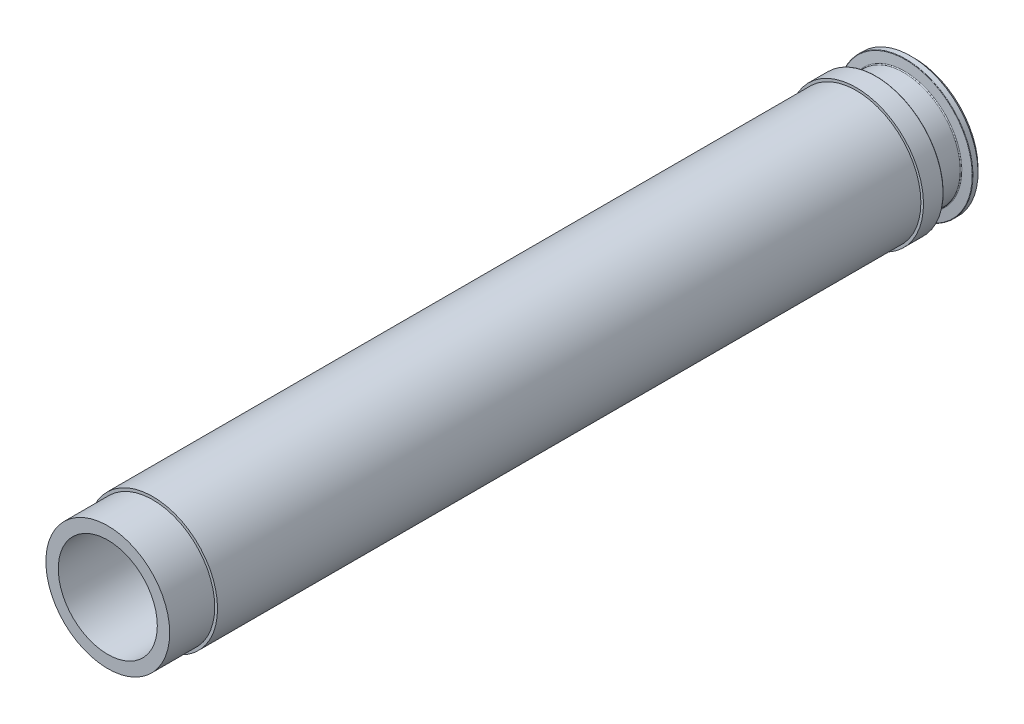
ISO-10303-21;
HEADER;
FILE_DESCRIPTION(('STEP AP214'),'2;1');
FILE_NAME('part.step','',(''),(''),'','','');
FILE_SCHEMA(('AUTOMOTIVE_DESIGN { 1 0 10303 214 1 1 1 1 }'));
ENDSEC;
DATA;
#1=APPLICATION_CONTEXT('core data for automotive mechanical design processes');
#2=APPLICATION_PROTOCOL_DEFINITION('international standard','automotive_design',2000,#1);
#3=PRODUCT_CONTEXT('',#1,'mechanical');
#4=PRODUCT('Part','Part','',(#3));
#5=PRODUCT_RELATED_PRODUCT_CATEGORY('part','',(#4));
#6=PRODUCT_DEFINITION_FORMATION('','',#4);
#7=PRODUCT_DEFINITION_CONTEXT('part definition',#1,'design');
#8=PRODUCT_DEFINITION('design','',#6,#7);
#9=PRODUCT_DEFINITION_SHAPE('','',#8);
#10=(LENGTH_UNIT() NAMED_UNIT(*) SI_UNIT(.MILLI.,.METRE.));
#11=(NAMED_UNIT(*) PLANE_ANGLE_UNIT() SI_UNIT($,.RADIAN.));
#12=(NAMED_UNIT(*) SI_UNIT($,.STERADIAN.) SOLID_ANGLE_UNIT());
#13=UNCERTAINTY_MEASURE_WITH_UNIT(LENGTH_MEASURE(1.E-05),#10,'distance_accuracy_value','');
#14=(GEOMETRIC_REPRESENTATION_CONTEXT(3) GLOBAL_UNCERTAINTY_ASSIGNED_CONTEXT((#13)) GLOBAL_UNIT_ASSIGNED_CONTEXT((#10,
#11,#12)) REPRESENTATION_CONTEXT('',''));
#15=CARTESIAN_POINT('',(0.,0.,0.));
#16=DIRECTION('',(0.,0.,1.));
#17=DIRECTION('',(1.,0.,0.));
#18=AXIS2_PLACEMENT_3D('',#15,#16,#17);
#19=CARTESIAN_POINT('',(0.,0.,-12.7));
#20=DIRECTION('',(0.,0.,1.));
#21=DIRECTION('',(1.,0.,0.));
#22=AXIS2_PLACEMENT_3D('',#19,#20,#21);
#23=CYLINDRICAL_SURFACE('',#22,17.4625);
#24=CARTESIAN_POINT('',(0.,0.,-12.7));
#25=DIRECTION('',(0.,0.,1.));
#26=DIRECTION('',(1.,0.,0.));
#27=AXIS2_PLACEMENT_3D('',#24,#25,#26);
#28=CIRCLE('',#27,17.4625);
#29=CARTESIAN_POINT('',(17.4625,0.,-12.7));
#30=VERTEX_POINT('',#29);
#31=EDGE_CURVE('E29',#30,#30,#28,.T.);
#32=ORIENTED_EDGE('',*,*,#31,.T.);
#33=EDGE_LOOP('',(#32));
#34=FACE_BOUND('',#33,.T.);
#35=CARTESIAN_POINT('',(0.,0.,0.));
#36=DIRECTION('',(0.,0.,1.));
#37=DIRECTION('',(1.,0.,0.));
#38=AXIS2_PLACEMENT_3D('',#35,#36,#37);
#39=CIRCLE('',#38,17.4625);
#40=CARTESIAN_POINT('',(17.4625,0.,0.));
#41=VERTEX_POINT('',#40);
#42=EDGE_CURVE('E10',#41,#41,#39,.T.);
#43=ORIENTED_EDGE('',*,*,#42,.F.);
#44=EDGE_LOOP('',(#43));
#45=FACE_BOUND('',#44,.T.);
#46=ADVANCED_FACE('F26',(#34,#45),#23,.T.);
#47=CARTESIAN_POINT('',(0.,0.,0.));
#48=DIRECTION('',(0.,0.,1.));
#49=DIRECTION('',(1.,0.,0.));
#50=AXIS2_PLACEMENT_3D('',#47,#48,#49);
#51=PLANE('',#50);
#52=CARTESIAN_POINT('',(0.,0.,0.));
#53=DIRECTION('',(0.,0.,1.));
#54=DIRECTION('',(1.,0.,0.));
#55=AXIS2_PLACEMENT_3D('',#52,#53,#54);
#56=CIRCLE('',#55,13.97);
#57=CARTESIAN_POINT('',(13.97,0.,0.));
#58=VERTEX_POINT('',#57);
#59=EDGE_CURVE('E79',#58,#58,#56,.T.);
#60=ORIENTED_EDGE('',*,*,#59,.F.);
#61=EDGE_LOOP('',(#60));
#62=FACE_BOUND('',#61,.T.);
#63=ORIENTED_EDGE('',*,*,#42,.T.);
#64=EDGE_LOOP('',(#63));
#65=FACE_BOUND('',#64,.T.);
#66=ADVANCED_FACE('F85',(#62,#65),#51,.T.);
#67=CARTESIAN_POINT('',(0.,0.,-211.0994));
#68=DIRECTION('',(0.,0.,1.));
#69=DIRECTION('',(1.,0.,0.));
#70=AXIS2_PLACEMENT_3D('',#67,#68,#69);
#71=CYLINDRICAL_SURFACE('',#70,18.25625);
#72=CARTESIAN_POINT('',(0.,0.,-211.0994));
#73=DIRECTION('',(0.,0.,-1.));
#74=DIRECTION('',(-1.,0.,0.));
#75=AXIS2_PLACEMENT_3D('',#72,#73,#74);
#76=CIRCLE('',#75,18.25625);
#77=CARTESIAN_POINT('',(18.25625,0.,-211.0994));
#78=VERTEX_POINT('',#77);
#79=EDGE_CURVE('E36',#78,#78,#76,.T.);
#80=CARTESIAN_POINT('',(0.,0.,-12.7));
#81=DIRECTION('',(0.,0.,-1.));
#82=DIRECTION('',(-1.,0.,0.));
#83=AXIS2_PLACEMENT_3D('',#80,#81,#82);
#84=CIRCLE('',#83,18.25625);
#85=CARTESIAN_POINT('',(18.25625,0.,-12.7));
#86=VERTEX_POINT('',#85);
#87=EDGE_CURVE('E40',#86,#86,#84,.T.);
#88=CARTESIAN_POINT('',(18.25625,0.,-211.0994));
#89=CARTESIAN_POINT('',(18.25625,0.,-209.032739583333));
#90=CARTESIAN_POINT('',(18.25625,0.,-206.966079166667));
#91=CARTESIAN_POINT('',(18.25625,0.,-202.832758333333));
#92=CARTESIAN_POINT('',(18.25625,0.,-200.766097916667));
#93=CARTESIAN_POINT('',(18.25625,0.,-196.632777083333));
#94=CARTESIAN_POINT('',(18.25625,0.,-194.566116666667));
#95=CARTESIAN_POINT('',(18.25625,0.,-190.432795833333));
#96=CARTESIAN_POINT('',(18.25625,0.,-188.366135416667));
#97=CARTESIAN_POINT('',(18.25625,0.,-184.232814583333));
#98=CARTESIAN_POINT('',(18.25625,0.,-182.166154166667));
#99=CARTESIAN_POINT('',(18.25625,0.,-178.032833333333));
#100=CARTESIAN_POINT('',(18.25625,0.,-175.966172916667));
#101=CARTESIAN_POINT('',(18.25625,0.,-171.832852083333));
#102=CARTESIAN_POINT('',(18.25625,0.,-169.766191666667));
#103=CARTESIAN_POINT('',(18.25625,0.,-165.632870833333));
#104=CARTESIAN_POINT('',(18.25625,0.,-163.566210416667));
#105=CARTESIAN_POINT('',(18.25625,0.,-159.432889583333));
#106=CARTESIAN_POINT('',(18.25625,0.,-157.366229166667));
#107=CARTESIAN_POINT('',(18.25625,0.,-153.232908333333));
#108=CARTESIAN_POINT('',(18.25625,0.,-151.166247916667));
#109=CARTESIAN_POINT('',(18.25625,0.,-147.032927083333));
#110=CARTESIAN_POINT('',(18.25625,0.,-144.966266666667));
#111=CARTESIAN_POINT('',(18.25625,0.,-140.832945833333));
#112=CARTESIAN_POINT('',(18.25625,0.,-138.766285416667));
#113=CARTESIAN_POINT('',(18.25625,0.,-134.632964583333));
#114=CARTESIAN_POINT('',(18.25625,0.,-132.566304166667));
#115=CARTESIAN_POINT('',(18.25625,0.,-128.432983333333));
#116=CARTESIAN_POINT('',(18.25625,0.,-126.366322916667));
#117=CARTESIAN_POINT('',(18.25625,0.,-122.233002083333));
#118=CARTESIAN_POINT('',(18.25625,0.,-120.166341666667));
#119=CARTESIAN_POINT('',(18.25625,0.,-116.033020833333));
#120=CARTESIAN_POINT('',(18.25625,0.,-113.966360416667));
#121=CARTESIAN_POINT('',(18.25625,0.,-109.833039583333));
#122=CARTESIAN_POINT('',(18.25625,0.,-107.766379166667));
#123=CARTESIAN_POINT('',(18.25625,0.,-103.633058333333));
#124=CARTESIAN_POINT('',(18.25625,0.,-101.566397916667));
#125=CARTESIAN_POINT('',(18.25625,0.,-97.4330770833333));
#126=CARTESIAN_POINT('',(18.25625,0.,-95.3664166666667));
#127=CARTESIAN_POINT('',(18.25625,0.,-91.2330958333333));
#128=CARTESIAN_POINT('',(18.25625,0.,-89.1664354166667));
#129=CARTESIAN_POINT('',(18.25625,0.,-85.0331145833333));
#130=CARTESIAN_POINT('',(18.25625,0.,-82.9664541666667));
#131=CARTESIAN_POINT('',(18.25625,0.,-78.8331333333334));
#132=CARTESIAN_POINT('',(18.25625,0.,-76.7664729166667));
#133=CARTESIAN_POINT('',(18.25625,0.,-72.6331520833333));
#134=CARTESIAN_POINT('',(18.25625,0.,-70.5664916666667));
#135=CARTESIAN_POINT('',(18.25625,0.,-66.4331708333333));
#136=CARTESIAN_POINT('',(18.25625,0.,-64.3665104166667));
#137=CARTESIAN_POINT('',(18.25625,0.,-60.2331895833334));
#138=CARTESIAN_POINT('',(18.25625,0.,-58.1665291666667));
#139=CARTESIAN_POINT('',(18.25625,0.,-54.0332083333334));
#140=CARTESIAN_POINT('',(18.25625,0.,-51.9665479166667));
#141=CARTESIAN_POINT('',(18.25625,0.,-47.8332270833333));
#142=CARTESIAN_POINT('',(18.25625,0.,-45.7665666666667));
#143=CARTESIAN_POINT('',(18.25625,0.,-41.6332458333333));
#144=CARTESIAN_POINT('',(18.25625,0.,-39.5665854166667));
#145=CARTESIAN_POINT('',(18.25625,0.,-35.4332645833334));
#146=CARTESIAN_POINT('',(18.25625,0.,-33.3666041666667));
#147=CARTESIAN_POINT('',(18.25625,0.,-29.2332833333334));
#148=CARTESIAN_POINT('',(18.25625,0.,-27.1666229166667));
#149=CARTESIAN_POINT('',(18.25625,0.,-23.0333020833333));
#150=CARTESIAN_POINT('',(18.25625,0.,-20.9666416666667));
#151=CARTESIAN_POINT('',(18.25625,0.,-16.8333208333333));
#152=CARTESIAN_POINT('',(18.25625,0.,-14.7666604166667));
#153=CARTESIAN_POINT('',(18.25625,0.,-12.7));
#154=B_SPLINE_CURVE_WITH_KNOTS('',3,(#88,#89,#90,#91,#92,#93,#94,#95,#96,#97,#98,#99,#100,#101,
#102,#103,#104,#105,#106,#107,#108,#109,#110,#111,#112,#113,#114,#115,#116,#117,#118,#119,#120,
#121,#122,#123,#124,#125,#126,#127,#128,#129,#130,#131,#132,#133,#134,#135,#136,#137,#138,#139,
#140,#141,#142,#143,#144,#145,#146,#147,#148,#149,#150,#151,#152,#153),.UNSPECIFIED.,.F.,.F.,(4,
2,2,2,2,2,2,2,2,2,2,2,2,2,2,2,2,2,2,2,2,2,2,2,2,2,2,2,2,2,2,2,4),(0.,6.19998125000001,
12.3999625,18.59994375,24.799925,30.99990625,37.1998875,43.39986875,49.59985,55.79983125,
61.9998125,68.19979375,74.399775,80.59975625,86.7997375,92.99971875,99.1997,105.39968125,
111.5996625,117.79964375,123.999625,130.19960625,136.3995875,142.59956875,148.79955,
154.99953125,161.1995125,167.39949375,173.599475,179.79945625,185.9994375,192.19941875,
198.3994),.UNSPECIFIED.);
#155=EDGE_CURVE('BSEAM87',#78,#86,#154,.T.);
#156=ORIENTED_EDGE('',*,*,#79,.F.);
#157=ORIENTED_EDGE('',*,*,#87,.T.);
#158=ORIENTED_EDGE('',*,*,#155,.T.);
#159=ORIENTED_EDGE('',*,*,#155,.F.);
#160=EDGE_LOOP('',(#156,#158,#157,#159));
#161=FACE_BOUND('',#160,.T.);
#162=ADVANCED_FACE('F87',(#161),#71,.T.);
#163=CARTESIAN_POINT('',(0.,0.,-12.7));
#164=DIRECTION('',(0.,0.,-1.));
#165=DIRECTION('',(-1.,0.,0.));
#166=AXIS2_PLACEMENT_3D('',#163,#164,#165);
#167=PLANE('',#166);
#168=ORIENTED_EDGE('',*,*,#31,.F.);
#169=EDGE_LOOP('',(#168));
#170=FACE_BOUND('',#169,.T.);
#171=ORIENTED_EDGE('',*,*,#87,.F.);
#172=EDGE_LOOP('',(#171));
#173=FACE_BOUND('',#172,.T.);
#174=ADVANCED_FACE('F92',(#170,#173),#167,.F.);
#175=CARTESIAN_POINT('',(0.,0.,-211.0994));
#176=DIRECTION('',(0.,0.,-1.));
#177=DIRECTION('',(0.,1.,0.));
#178=AXIS2_PLACEMENT_3D('',#175,#176,#177);
#179=PLANE('',#178);
#180=CARTESIAN_POINT('',(0.,0.,-211.0994));
#181=DIRECTION('',(0.,0.,1.));
#182=DIRECTION('',(0.,-1.,0.));
#183=AXIS2_PLACEMENT_3D('',#180,#181,#182);
#184=CIRCLE('',#183,18.9865);
#185=CARTESIAN_POINT('',(0.,-18.9865,-211.0994));
#186=VERTEX_POINT('',#185);
#187=EDGE_CURVE('E58',#186,#186,#184,.T.);
#188=ORIENTED_EDGE('',*,*,#187,.T.);
#189=EDGE_LOOP('',(#188));
#190=FACE_BOUND('',#189,.T.);
#191=ORIENTED_EDGE('',*,*,#79,.T.);
#192=EDGE_LOOP('',(#191));
#193=FACE_BOUND('',#192,.T.);
#194=ADVANCED_FACE('F99',(#190,#193),#179,.F.);
#195=CARTESIAN_POINT('',(0.,0.,-224.466095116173));
#196=DIRECTION('',(0.,0.,1.));
#197=DIRECTION('',(0.,-1.,0.));
#198=AXIS2_PLACEMENT_3D('',#195,#196,#197);
#199=TOROIDAL_SURFACE('',#198,16.2179,0.253999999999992);
#200=CARTESIAN_POINT('',(0.,0.,-224.466095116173));
#201=DIRECTION('',(0.,0.,1.));
#202=DIRECTION('',(0.,-1.,0.));
#203=AXIS2_PLACEMENT_3D('',#200,#201,#202);
#204=CIRCLE('',#203,15.9639);
#205=CARTESIAN_POINT('',(0.,-15.9639,-224.466095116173));
#206=VERTEX_POINT('',#205);
#207=EDGE_CURVE('E43',#206,#206,#204,.T.);
#208=ORIENTED_EDGE('',*,*,#207,.F.);
#209=EDGE_LOOP('',(#208));
#210=FACE_BOUND('',#209,.T.);
#211=CARTESIAN_POINT('',(0.,0.,-224.719128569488));
#212=DIRECTION('',(0.,0.,1.));
#213=DIRECTION('',(0.,-1.,0.));
#214=AXIS2_PLACEMENT_3D('',#211,#212,#213);
#215=CIRCLE('',#214,16.1957624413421);
#216=CARTESIAN_POINT('',(0.,-16.1957624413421,-224.719128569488));
#217=VERTEX_POINT('',#216);
#218=EDGE_CURVE('E73',#217,#217,#215,.T.);
#219=ORIENTED_EDGE('',*,*,#218,.T.);
#220=EDGE_LOOP('',(#219));
#221=FACE_BOUND('',#220,.T.);
#222=ADVANCED_FACE('F101',(#210,#221),#199,.F.);
#223=CARTESIAN_POINT('',(0.,0.,-211.0994));
#224=DIRECTION('',(0.,0.,1.));
#225=DIRECTION('',(0.,-1.,0.));
#226=AXIS2_PLACEMENT_3D('',#223,#224,#225);
#227=CYLINDRICAL_SURFACE('',#226,15.9639);
#228=CARTESIAN_POINT('',(0.,0.,-217.209991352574));
#229=DIRECTION('',(0.,0.,1.));
#230=DIRECTION('',(0.,-1.,0.));
#231=AXIS2_PLACEMENT_3D('',#228,#229,#230);
#232=CIRCLE('',#231,15.9639);
#233=CARTESIAN_POINT('',(0.,-15.9639,-217.209991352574));
#234=VERTEX_POINT('',#233);
#235=EDGE_CURVE('E46',#234,#234,#232,.T.);
#236=ORIENTED_EDGE('',*,*,#235,.F.);
#237=EDGE_LOOP('',(#236));
#238=FACE_BOUND('',#237,.T.);
#239=ORIENTED_EDGE('',*,*,#207,.T.);
#240=EDGE_LOOP('',(#239));
#241=FACE_BOUND('',#240,.T.);
#242=ADVANCED_FACE('F104',(#238,#241),#227,.T.);
#243=CARTESIAN_POINT('',(0.,0.,-217.209991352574));
#244=DIRECTION('',(0.,0.,1.));
#245=DIRECTION('',(0.,-1.,0.));
#246=AXIS2_PLACEMENT_3D('',#243,#244,#245);
#247=TOROIDAL_SURFACE('',#246,16.2179,0.254000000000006);
#248=CARTESIAN_POINT('',(0.,0.,-216.956957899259));
#249=DIRECTION('',(0.,0.,1.));
#250=DIRECTION('',(0.,-1.,0.));
#251=AXIS2_PLACEMENT_3D('',#248,#249,#250);
#252=CIRCLE('',#251,16.1957624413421);
#253=CARTESIAN_POINT('',(0.,-16.1957624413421,-216.956957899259));
#254=VERTEX_POINT('',#253);
#255=EDGE_CURVE('E49',#254,#254,#252,.T.);
#256=ORIENTED_EDGE('',*,*,#255,.F.);
#257=EDGE_LOOP('',(#256));
#258=FACE_BOUND('',#257,.T.);
#259=ORIENTED_EDGE('',*,*,#235,.T.);
#260=EDGE_LOOP('',(#259));
#261=FACE_BOUND('',#260,.T.);
#262=ADVANCED_FACE('F108',(#258,#261),#247,.F.);
#263=CARTESIAN_POINT('',(0.,0.,-216.956957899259));
#264=DIRECTION('',(0.,0.,1.));
#265=DIRECTION('',(0.,-1.,0.));
#266=AXIS2_PLACEMENT_3D('',#263,#264,#265);
#267=CONICAL_SURFACE('',#266,16.1957624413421,1.48352986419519);
#268=CARTESIAN_POINT('',(0.,0.,-216.722942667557));
#269=DIRECTION('',(0.,0.,1.));
#270=DIRECTION('',(0.,-1.,0.));
#271=AXIS2_PLACEMENT_3D('',#268,#269,#270);
#272=CIRCLE('',#271,18.870568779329);
#273=CARTESIAN_POINT('',(0.,-18.870568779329,-216.722942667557));
#274=VERTEX_POINT('',#273);
#275=EDGE_CURVE('E52',#274,#274,#272,.T.);
#276=ORIENTED_EDGE('',*,*,#275,.F.);
#277=EDGE_LOOP('',(#276));
#278=FACE_BOUND('',#277,.T.);
#279=ORIENTED_EDGE('',*,*,#255,.T.);
#280=EDGE_LOOP('',(#279));
#281=FACE_BOUND('',#280,.T.);
#282=ADVANCED_FACE('F112',(#278,#281),#267,.T.);
#283=CARTESIAN_POINT('',(0.,0.,-216.5964259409));
#284=DIRECTION('',(0.,0.,1.));
#285=DIRECTION('',(0.,-1.,0.));
#286=AXIS2_PLACEMENT_3D('',#283,#284,#285);
#287=TOROIDAL_SURFACE('',#286,18.8595,0.127000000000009);
#288=CARTESIAN_POINT('',(0.,0.,-216.5964259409));
#289=DIRECTION('',(0.,0.,1.));
#290=DIRECTION('',(0.,-1.,0.));
#291=AXIS2_PLACEMENT_3D('',#288,#289,#290);
#292=CIRCLE('',#291,18.9865);
#293=CARTESIAN_POINT('',(0.,-18.9865,-216.5964259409));
#294=VERTEX_POINT('',#293);
#295=EDGE_CURVE('E55',#294,#294,#292,.T.);
#296=ORIENTED_EDGE('',*,*,#295,.F.);
#297=EDGE_LOOP('',(#296));
#298=FACE_BOUND('',#297,.T.);
#299=ORIENTED_EDGE('',*,*,#275,.T.);
#300=EDGE_LOOP('',(#299));
#301=FACE_BOUND('',#300,.T.);
#302=ADVANCED_FACE('F116',(#298,#301),#287,.T.);
#303=CARTESIAN_POINT('',(0.,0.,-211.0994));
#304=DIRECTION('',(0.,0.,1.));
#305=DIRECTION('',(0.,-1.,0.));
#306=AXIS2_PLACEMENT_3D('',#303,#304,#305);
#307=CYLINDRICAL_SURFACE('',#306,18.9865);
#308=ORIENTED_EDGE('',*,*,#187,.F.);
#309=EDGE_LOOP('',(#308));
#310=FACE_BOUND('',#309,.T.);
#311=ORIENTED_EDGE('',*,*,#295,.T.);
#312=EDGE_LOOP('',(#311));
#313=FACE_BOUND('',#312,.T.);
#314=ADVANCED_FACE('F120',(#310,#313),#307,.T.);
#315=CARTESIAN_POINT('',(0.,0.,-227.503286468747));
#316=DIRECTION('',(0.,0.,1.));
#317=DIRECTION('',(0.,-1.,0.));
#318=AXIS2_PLACEMENT_3D('',#315,#316,#317);
#319=PLANE('',#318);
#320=CARTESIAN_POINT('',(0.,0.,-227.503286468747));
#321=DIRECTION('',(0.,0.,1.));
#322=DIRECTION('',(0.,-1.,0.));
#323=AXIS2_PLACEMENT_3D('',#320,#321,#322);
#324=CIRCLE('',#323,17.9705);
#325=CARTESIAN_POINT('',(0.,-17.9705,-227.503286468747));
#326=VERTEX_POINT('',#325);
#327=EDGE_CURVE('E61',#326,#326,#324,.T.);
#328=ORIENTED_EDGE('',*,*,#327,.F.);
#329=EDGE_LOOP('',(#328));
#330=FACE_BOUND('',#329,.T.);
#331=ADVANCED_FACE('F124',(#330),#319,.F.);
#332=CARTESIAN_POINT('',(0.,0.,-227.503286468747));
#333=DIRECTION('',(0.,0.,1.));
#334=DIRECTION('',(0.,-1.,0.));
#335=AXIS2_PLACEMENT_3D('',#332,#333,#334);
#336=CONICAL_SURFACE('',#335,17.9705,0.78539816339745);
#337=CARTESIAN_POINT('',(0.,0.,-226.487286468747));
#338=DIRECTION('',(0.,0.,1.));
#339=DIRECTION('',(0.,-1.,0.));
#340=AXIS2_PLACEMENT_3D('',#337,#338,#339);
#341=CIRCLE('',#340,18.9865);
#342=CARTESIAN_POINT('',(0.,-18.9865,-226.487286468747));
#343=VERTEX_POINT('',#342);
#344=EDGE_CURVE('E64',#343,#343,#341,.T.);
#345=ORIENTED_EDGE('',*,*,#344,.F.);
#346=EDGE_LOOP('',(#345));
#347=FACE_BOUND('',#346,.T.);
#348=ORIENTED_EDGE('',*,*,#327,.T.);
#349=EDGE_LOOP('',(#348));
#350=FACE_BOUND('',#349,.T.);
#351=ADVANCED_FACE('F131',(#347,#350),#336,.T.);
#352=CARTESIAN_POINT('',(0.,0.,-211.0994));
#353=DIRECTION('',(0.,0.,1.));
#354=DIRECTION('',(0.,-1.,0.));
#355=AXIS2_PLACEMENT_3D('',#352,#353,#354);
#356=CYLINDRICAL_SURFACE('',#355,18.9865);
#357=CARTESIAN_POINT('',(0.,0.,-225.079660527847));
#358=DIRECTION('',(0.,0.,1.));
#359=DIRECTION('',(0.,-1.,0.));
#360=AXIS2_PLACEMENT_3D('',#357,#358,#359);
#361=CIRCLE('',#360,18.9865);
#362=CARTESIAN_POINT('',(0.,-18.9865,-225.079660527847));
#363=VERTEX_POINT('',#362);
#364=EDGE_CURVE('E67',#363,#363,#361,.T.);
#365=ORIENTED_EDGE('',*,*,#364,.F.);
#366=EDGE_LOOP('',(#365));
#367=FACE_BOUND('',#366,.T.);
#368=ORIENTED_EDGE('',*,*,#344,.T.);
#369=EDGE_LOOP('',(#368));
#370=FACE_BOUND('',#369,.T.);
#371=ADVANCED_FACE('F135',(#367,#370),#356,.T.);
#372=CARTESIAN_POINT('',(0.,0.,-225.079660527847));
#373=DIRECTION('',(0.,0.,1.));
#374=DIRECTION('',(0.,-1.,0.));
#375=AXIS2_PLACEMENT_3D('',#372,#373,#374);
#376=TOROIDAL_SURFACE('',#375,18.8595,0.127000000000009);
#377=CARTESIAN_POINT('',(0.,0.,-224.953143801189));
#378=DIRECTION('',(0.,0.,1.));
#379=DIRECTION('',(0.,-1.,0.));
#380=AXIS2_PLACEMENT_3D('',#377,#378,#379);
#381=CIRCLE('',#380,18.8705687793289);
#382=CARTESIAN_POINT('',(0.,-18.8705687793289,-224.953143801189));
#383=VERTEX_POINT('',#382);
#384=EDGE_CURVE('E70',#383,#383,#381,.T.);
#385=ORIENTED_EDGE('',*,*,#384,.F.);
#386=EDGE_LOOP('',(#385));
#387=FACE_BOUND('',#386,.T.);
#388=ORIENTED_EDGE('',*,*,#364,.T.);
#389=EDGE_LOOP('',(#388));
#390=FACE_BOUND('',#389,.T.);
#391=ADVANCED_FACE('F139',(#387,#390),#376,.T.);
#392=CARTESIAN_POINT('',(0.,0.,-224.953143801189));
#393=DIRECTION('',(0.,0.,-1.));
#394=DIRECTION('',(0.,1.,0.));
#395=AXIS2_PLACEMENT_3D('',#392,#393,#394);
#396=CONICAL_SURFACE('',#395,18.8705687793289,1.48352986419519);
#397=ORIENTED_EDGE('',*,*,#218,.F.);
#398=EDGE_LOOP('',(#397));
#399=FACE_BOUND('',#398,.T.);
#400=ORIENTED_EDGE('',*,*,#384,.T.);
#401=EDGE_LOOP('',(#400));
#402=FACE_BOUND('',#401,.T.);
#403=ADVANCED_FACE('F143',(#399,#402),#396,.T.);
#404=CARTESIAN_POINT('',(0.,0.,-211.074));
#405=DIRECTION('',(0.,0.,1.));
#406=DIRECTION('',(1.,0.,0.));
#407=AXIS2_PLACEMENT_3D('',#404,#405,#406);
#408=CYLINDRICAL_SURFACE('',#407,13.97);
#409=CARTESIAN_POINT('',(0.,0.,-211.074));
#410=DIRECTION('',(0.,0.,1.));
#411=DIRECTION('',(1.,0.,0.));
#412=AXIS2_PLACEMENT_3D('',#409,#410,#411);
#413=CIRCLE('',#412,13.97);
#414=CARTESIAN_POINT('',(13.97,0.,-211.074));
#415=VERTEX_POINT('',#414);
#416=EDGE_CURVE('E76',#415,#415,#413,.T.);
#417=ORIENTED_EDGE('',*,*,#416,.F.);
#418=EDGE_LOOP('',(#417));
#419=FACE_BOUND('',#418,.T.);
#420=ORIENTED_EDGE('',*,*,#59,.T.);
#421=EDGE_LOOP('',(#420));
#422=FACE_BOUND('',#421,.T.);
#423=ADVANCED_FACE('F83',(#419,#422),#408,.F.);
#424=CARTESIAN_POINT('',(0.,0.,-211.074));
#425=DIRECTION('',(0.,0.,1.));
#426=DIRECTION('',(1.,0.,0.));
#427=AXIS2_PLACEMENT_3D('',#424,#425,#426);
#428=PLANE('',#427);
#429=ORIENTED_EDGE('',*,*,#416,.T.);
#430=EDGE_LOOP('',(#429));
#431=FACE_BOUND('',#430,.T.);
#432=ADVANCED_FACE('F150',(#431),#428,.T.);
#433=CLOSED_SHELL('',(#46,#66,#162,#174,#194,#222,#242,#262,#282,#302,#314,#331,#351,#371,#391,
#403,#423,#432));
#434=MANIFOLD_SOLID_BREP('B2',#433);
#435=ADVANCED_BREP_SHAPE_REPRESENTATION('',(#18,#434),#14);
#436=SHAPE_DEFINITION_REPRESENTATION(#9,#435);
ENDSEC;
END-ISO-10303-21;
